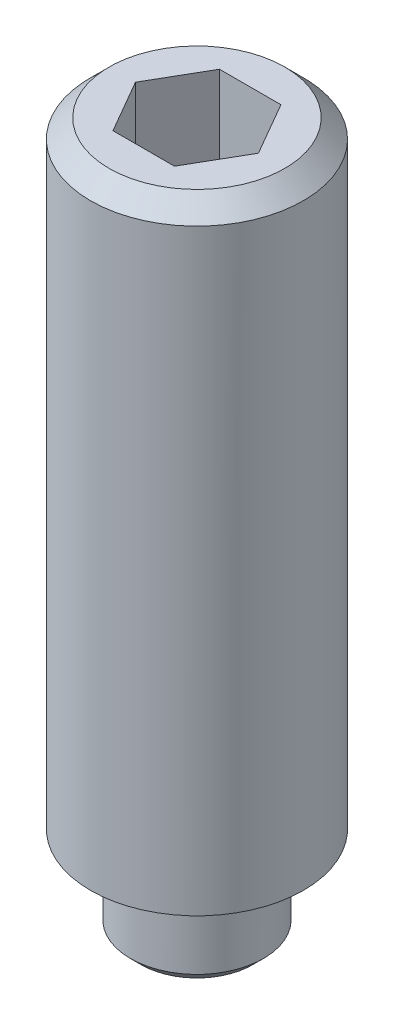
from build123d import *

# Parameters (mm, degrees)
ESQUISSE1_R             = 2
LONGUEUR_FILT_DEPTH     = 12
CHANFREIN1_SIZE         = 0.35
ENL_V_MAT_EXTRU_4_DEPTH = 2.5
ESQUISSE7_OUTSIDE_W     = 54.826
ESQUISSE7_OUTSIDE_H     = 54.826
ESQUISSE7_OUTSIDE_R     = 1.25
ENL_V_MAT_EXTRU_6_DEPTH = 13.328828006
ENL_V_MAT_EXTRU_6_DRAFT = -60
ESQUISSE8_R             = 1.25
EXTRUSION1_DEPTH        = 1.25
CHANFREIN2_SIZE         = 0.2


with BuildPart() as part:
    # Esquisse1 → Longueur filt (new body)
    with BuildSketch(Plane(origin=(0, 0, 0), x_dir=(1, 0, 0), z_dir=(0, 1, 0))):
        with Locations(Location((0, 0, 0), (0, 0, 270))):
            Circle(ESQUISSE1_R)
    extrude(amount=LONGUEUR_FILT_DEPTH)

    # Chanfrein1
    chanfrein1_edges = [part.edges().sort_by_distance(p)[0] for p in [
        (0, 12, -2),
    ]]
    chamfer(chanfrein1_edges, length=CHANFREIN1_SIZE)

    # Esquisse6 → Enl_v. mat.-Extru.4 (cut)
    with BuildSketch(Plane(origin=(0, 12, 0), x_dir=(-1, 0, 0), z_dir=(0, -1, 0))):
        Polygon((1.154700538, 0), (0.577350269, 1), (-0.577350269, 1), (-1.154700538, 0), (-0.577350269, -1), (0.577350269, -1), align=None)
    extrude(amount=ENL_V_MAT_EXTRU_4_DEPTH, mode=Mode.SUBTRACT)


with BuildPart() as enl_v_mat_extru_6_tool:
    # Esquisse7 outside → Enl_v. mat.-Extru.6 (with draft: the straight prism first)
    with BuildSketch(Plane.XZ):
        Rectangle(ESQUISSE7_OUTSIDE_W, ESQUISSE7_OUTSIDE_H)
        Circle(ESQUISSE7_OUTSIDE_R, mode=Mode.SUBTRACT)
    extrude(amount=-ENL_V_MAT_EXTRU_6_DEPTH)
    # Enl_v. mat.-Extru.6: the draft: its side faces are tilted about the plane it starts from
    enl_v_mat_extru_6_sides = [enl_v_mat_extru_6_tool.faces().sort_by_distance(p)[0] for p in [
        (0, 6.664414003, -27.413),
        (27.413, 6.664414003, 0),
        (0, 6.664414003, 27.413),
        (-27.413, 6.664414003, 0),
        (-1.25, 6.664414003, 0),
    ]]
    draft(enl_v_mat_extru_6_sides, Plane.XZ, ENL_V_MAT_EXTRU_6_DRAFT)


with BuildPart() as part_1:
    add(part.part)

    # Enl_v. mat.-Extru.6: cut by enl_v_mat_extru_6_tool
    add(enl_v_mat_extru_6_tool.part, mode=Mode.SUBTRACT)

    # Esquisse8 → Extrusion1 (add)
    with BuildSketch(Plane.XZ):
        with Locations(Location((0, 0, 0), (0, 0, 270))):
            Circle(ESQUISSE8_R)
    extrude(amount=EXTRUSION1_DEPTH)

    # Chanfrein2
    chanfrein2_edges = [part_1.edges().sort_by_distance(p)[0] for p in [
        (0, -1.25, 1.25),
    ]]
    chamfer(chanfrein2_edges, length=CHANFREIN2_SIZE)


solid = part_1.part
